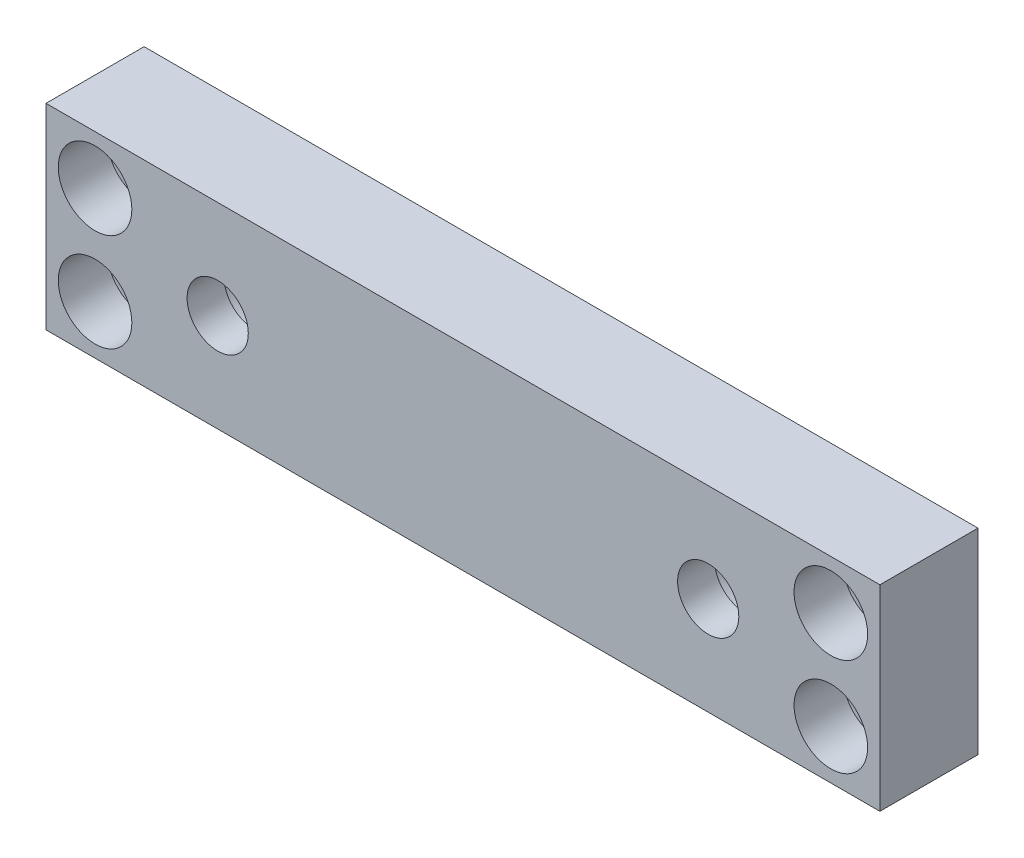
from build123d import *

# Parameters (mm, degrees)
SKETCH2_W           = 107.95
SKETCH2_H           = 25.4
SKETCH2_R           = 3.9624
SKETCH2_R_2         = 3.175
BOSS_EXTRUDE1_DEPTH = 12.7
SKETCH3_R           = 6
CUT_EXTRUDE1_DEPTH  = 7.9248
CUT_EXTRUDE2_START  = 6.35
SKETCH4_R           = 4.7625
CUT_EXTRUDE2_DEPTH  = 25.4


with BuildPart() as part:
    # Sketch2 → Boss-Extrude1 (new body)
    with BuildSketch(Plane.XY):
        Rectangle(SKETCH2_W, SKETCH2_H)
        with Locations((-31.75, 0)):
            Circle(SKETCH2_R, mode=Mode.SUBTRACT)
        with Locations((-47.625, -6.35)):
            Circle(SKETCH2_R_2, mode=Mode.SUBTRACT)
        with Locations((-47.625, 6.35)):
            Circle(SKETCH2_R_2, mode=Mode.SUBTRACT)
        with Locations((31.75, 0)):
            Circle(SKETCH2_R, mode=Mode.SUBTRACT)
        with Locations((47.625, 6.35)):
            Circle(SKETCH2_R_2, mode=Mode.SUBTRACT)
        with Locations((47.625, -6.35)):
            Circle(SKETCH2_R_2, mode=Mode.SUBTRACT)
    extrude(amount=BOSS_EXTRUDE1_DEPTH)

    # Sketch3 → Cut-Extrude1 (cut)
    with BuildSketch(Plane.XY):
        with Locations((31.75, 0)):
            Circle(SKETCH3_R)
        with Locations((-31.75, 0)):
            Circle(SKETCH3_R)
    extrude(amount=CUT_EXTRUDE1_DEPTH, mode=Mode.SUBTRACT)

    # Sketch4 → Cut-Extrude2 (cut)
    with BuildSketch(Plane.XY.offset(CUT_EXTRUDE2_START)):
        with Locations((-47.625, -6.35)):
            Circle(SKETCH4_R)
        with Locations((-47.625, 6.35)):
            Circle(SKETCH4_R)
        with Locations((47.625, -6.35)):
            Circle(SKETCH4_R)
        with Locations((47.625, 6.35)):
            Circle(SKETCH4_R)
    extrude(amount=CUT_EXTRUDE2_DEPTH, mode=Mode.SUBTRACT)


solid = part.part
